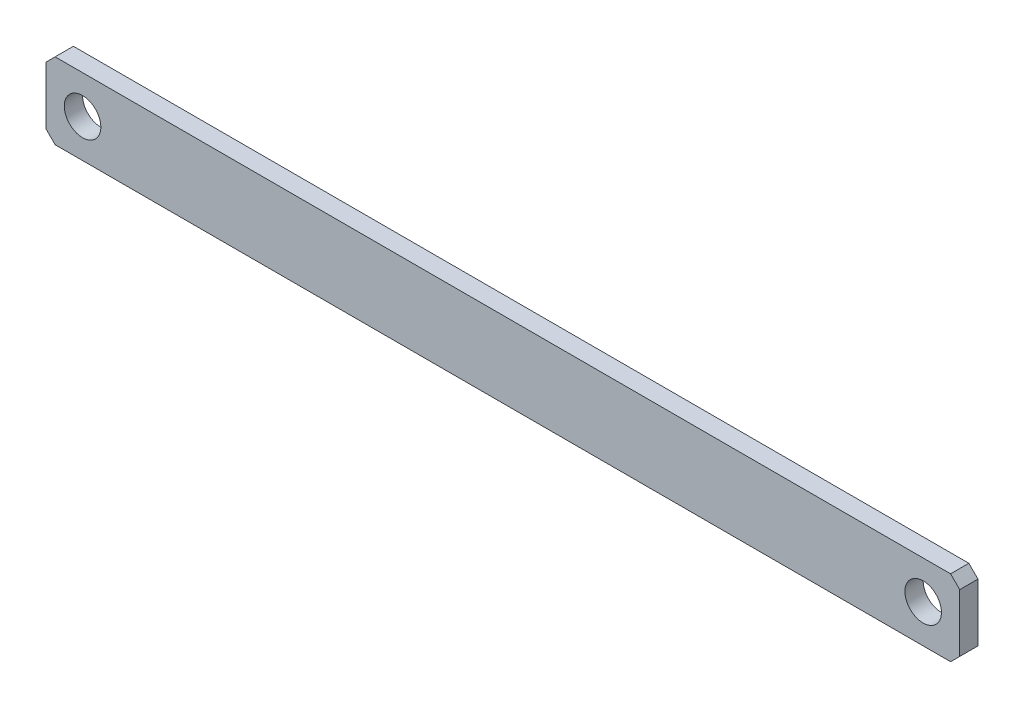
from build123d import *

# Parameters (mm, degrees)
SKETCH1_W     = 76.2
SKETCH1_H     = 6.35
PLATE_DEPTH   = 1.524
SKETCH2_R     = 1.524
HOLES_DEPTH   = 1.524
CHAMFER1_SIZE = 0.762


with BuildPart() as part:
    # Sketch1 → plate (new body)
    with BuildSketch(Plane.XY):
        with Locations((38.1, 4.798308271)):
            Rectangle(SKETCH1_W, SKETCH1_H)
    extrude(amount=PLATE_DEPTH)

    # Sketch2 → holes (cut)
    with BuildSketch(Plane.XY):
        with Locations(Location((3.048, 4.798308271, 0), (0, 0, 180))):
            Circle(SKETCH2_R)
        with Locations(Location((73.152, 4.798308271, 0), (0, 0, 180))):
            Circle(SKETCH2_R)
    extrude(amount=HOLES_DEPTH, mode=Mode.SUBTRACT)

    # Chamfer1
    chamfer1_edges = [part.edges().sort_by_distance(p)[0] for p in [
        (0, 7.973308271, 0.762),
        (76.2, 7.973308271, 0.762),
        (76.2, 1.623308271, 0.762),
        (0, 1.623308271, 0.762),
    ]]
    chamfer(chamfer1_edges, length=CHAMFER1_SIZE)


solid = part.part
